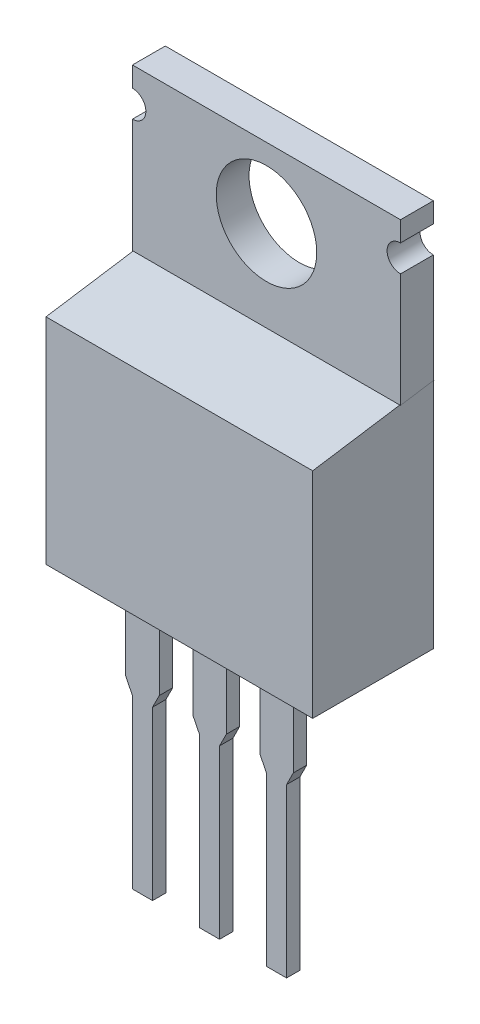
ISO-10303-21;
HEADER;
FILE_DESCRIPTION(('STEP AP214'),'2;1');
FILE_NAME('part.step','',(''),(''),'','','');
FILE_SCHEMA(('AUTOMOTIVE_DESIGN { 1 0 10303 214 1 1 1 1 }'));
ENDSEC;
DATA;
#1=APPLICATION_CONTEXT('core data for automotive mechanical design processes');
#2=APPLICATION_PROTOCOL_DEFINITION('international standard','automotive_design',2000,#1);
#3=PRODUCT_CONTEXT('',#1,'mechanical');
#4=PRODUCT('Part','Part','',(#3));
#5=PRODUCT_RELATED_PRODUCT_CATEGORY('part','',(#4));
#6=PRODUCT_DEFINITION_FORMATION('','',#4);
#7=PRODUCT_DEFINITION_CONTEXT('part definition',#1,'design');
#8=PRODUCT_DEFINITION('design','',#6,#7);
#9=PRODUCT_DEFINITION_SHAPE('','',#8);
#10=(LENGTH_UNIT() NAMED_UNIT(*) SI_UNIT(.MILLI.,.METRE.));
#11=(NAMED_UNIT(*) PLANE_ANGLE_UNIT() SI_UNIT($,.RADIAN.));
#12=(NAMED_UNIT(*) SI_UNIT($,.STERADIAN.) SOLID_ANGLE_UNIT());
#13=UNCERTAINTY_MEASURE_WITH_UNIT(LENGTH_MEASURE(1.E-05),#10,'distance_accuracy_value','');
#14=(GEOMETRIC_REPRESENTATION_CONTEXT(3) GLOBAL_UNCERTAINTY_ASSIGNED_CONTEXT((#13)) GLOBAL_UNIT_ASSIGNED_CONTEXT((#10,
#11,#12)) REPRESENTATION_CONTEXT('',''));
#15=CARTESIAN_POINT('',(0.,0.,0.));
#16=DIRECTION('',(0.,0.,1.));
#17=DIRECTION('',(1.,0.,0.));
#18=AXIS2_PLACEMENT_3D('',#15,#16,#17);
#19=CARTESIAN_POINT('',(-2.54,3.81,-3.175));
#20=DIRECTION('',(0.,1.,0.));
#21=DIRECTION('',(0.,0.,1.));
#22=AXIS2_PLACEMENT_3D('',#19,#20,#21);
#23=PLANE('',#22);
#24=DIRECTION('',(1.,0.,0.));
#25=VECTOR('',#24,1.);
#26=CARTESIAN_POINT('',(1.905,3.81,0.254));
#27=LINE('',#26,#25);
#28=CARTESIAN_POINT('',(1.905,3.81,0.254));
#29=VERTEX_POINT('',#28);
#30=CARTESIAN_POINT('',(3.175,3.81,0.254));
#31=VERTEX_POINT('',#30);
#32=EDGE_CURVE('E363',#29,#31,#27,.T.);
#33=ORIENTED_EDGE('',*,*,#32,.T.);
#34=DIRECTION('',(0.,0.,-1.));
#35=VECTOR('',#34,1.);
#36=CARTESIAN_POINT('',(3.175,3.81,0.254));
#37=LINE('',#36,#35);
#38=CARTESIAN_POINT('',(3.175,3.81,-0.254));
#39=VERTEX_POINT('',#38);
#40=EDGE_CURVE('E379',#31,#39,#37,.T.);
#41=ORIENTED_EDGE('',*,*,#40,.T.);
#42=DIRECTION('',(1.,0.,0.));
#43=VECTOR('',#42,1.);
#44=CARTESIAN_POINT('',(1.905,3.81,-0.254));
#45=LINE('',#44,#43);
#46=CARTESIAN_POINT('',(1.905,3.81,-0.254));
#47=VERTEX_POINT('',#46);
#48=EDGE_CURVE('E357',#47,#39,#45,.T.);
#49=ORIENTED_EDGE('',*,*,#48,.F.);
#50=DIRECTION('',(0.,0.,-1.));
#51=VECTOR('',#50,1.);
#52=CARTESIAN_POINT('',(1.905,3.81,0.254));
#53=LINE('',#52,#51);
#54=EDGE_CURVE('E366',#29,#47,#53,.T.);
#55=ORIENTED_EDGE('',*,*,#54,.F.);
#56=EDGE_LOOP('',(#33,#41,#49,#55));
#57=FACE_BOUND('',#56,.T.);
#58=DIRECTION('',(0.,0.,-1.));
#59=VECTOR('',#58,1.);
#60=CARTESIAN_POINT('',(7.5946,3.81,1.397));
#61=LINE('',#60,#59);
#62=CARTESIAN_POINT('',(7.5946,3.81,1.397));
#63=VERTEX_POINT('',#62);
#64=CARTESIAN_POINT('',(7.5946,3.81,-3.175));
#65=VERTEX_POINT('',#64);
#66=EDGE_CURVE('E505',#63,#65,#61,.T.);
#67=ORIENTED_EDGE('',*,*,#66,.F.);
#68=DIRECTION('',(1.,0.,0.));
#69=VECTOR('',#68,1.);
#70=CARTESIAN_POINT('',(-2.54,3.81,1.397));
#71=LINE('',#70,#69);
#72=CARTESIAN_POINT('',(-2.5146,3.81,1.397));
#73=VERTEX_POINT('',#72);
#74=EDGE_CURVE('E553',#73,#63,#71,.T.);
#75=ORIENTED_EDGE('',*,*,#74,.F.);
#76=DIRECTION('',(0.,0.,1.));
#77=VECTOR('',#76,1.);
#78=CARTESIAN_POINT('',(-2.5146,3.81,-3.175));
#79=LINE('',#78,#77);
#80=CARTESIAN_POINT('',(-2.5146,3.81,-3.175));
#81=VERTEX_POINT('',#80);
#82=EDGE_CURVE('E528',#81,#73,#79,.T.);
#83=ORIENTED_EDGE('',*,*,#82,.F.);
#84=DIRECTION('',(-1.,0.,0.));
#85=VECTOR('',#84,1.);
#86=CARTESIAN_POINT('',(-2.54,3.81,-3.175));
#87=LINE('',#86,#85);
#88=EDGE_CURVE('E557',#65,#81,#87,.T.);
#89=ORIENTED_EDGE('',*,*,#88,.F.);
#90=EDGE_LOOP('',(#67,#75,#83,#89));
#91=FACE_BOUND('',#90,.T.);
#92=DIRECTION('',(1.,0.,0.));
#93=VECTOR('',#92,1.);
#94=CARTESIAN_POINT('',(-0.635,3.81,0.254));
#95=LINE('',#94,#93);
#96=CARTESIAN_POINT('',(-0.635,3.81,0.254));
#97=VERTEX_POINT('',#96);
#98=CARTESIAN_POINT('',(0.635,3.81,0.254));
#99=VERTEX_POINT('',#98);
#100=EDGE_CURVE('E417',#97,#99,#95,.T.);
#101=ORIENTED_EDGE('',*,*,#100,.T.);
#102=DIRECTION('',(0.,0.,-1.));
#103=VECTOR('',#102,1.);
#104=CARTESIAN_POINT('',(0.635,3.81,0.254));
#105=LINE('',#104,#103);
#106=CARTESIAN_POINT('',(0.635,3.81,-0.254));
#107=VERTEX_POINT('',#106);
#108=EDGE_CURVE('E433',#99,#107,#105,.T.);
#109=ORIENTED_EDGE('',*,*,#108,.T.);
#110=DIRECTION('',(1.,0.,0.));
#111=VECTOR('',#110,1.);
#112=CARTESIAN_POINT('',(-0.635,3.81,-0.254));
#113=LINE('',#112,#111);
#114=CARTESIAN_POINT('',(-0.635,3.81,-0.254));
#115=VERTEX_POINT('',#114);
#116=EDGE_CURVE('E411',#115,#107,#113,.T.);
#117=ORIENTED_EDGE('',*,*,#116,.F.);
#118=DIRECTION('',(0.,0.,-1.));
#119=VECTOR('',#118,1.);
#120=CARTESIAN_POINT('',(-0.635,3.81,0.254));
#121=LINE('',#120,#119);
#122=EDGE_CURVE('E420',#97,#115,#121,.T.);
#123=ORIENTED_EDGE('',*,*,#122,.F.);
#124=EDGE_LOOP('',(#101,#109,#117,#123));
#125=FACE_BOUND('',#124,.T.);
#126=DIRECTION('',(1.,0.,0.));
#127=VECTOR('',#126,1.);
#128=CARTESIAN_POINT('',(4.445,3.81,0.253999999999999));
#129=LINE('',#128,#127);
#130=CARTESIAN_POINT('',(4.445,3.81,0.253999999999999));
#131=VERTEX_POINT('',#130);
#132=CARTESIAN_POINT('',(5.715,3.81,0.253999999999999));
#133=VERTEX_POINT('',#132);
#134=EDGE_CURVE('E322',#131,#133,#129,.T.);
#135=ORIENTED_EDGE('',*,*,#134,.T.);
#136=DIRECTION('',(0.,0.,-1.));
#137=VECTOR('',#136,1.);
#138=CARTESIAN_POINT('',(5.715,3.81,0.253999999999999));
#139=LINE('',#138,#137);
#140=CARTESIAN_POINT('',(5.715,3.81,-0.254000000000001));
#141=VERTEX_POINT('',#140);
#142=EDGE_CURVE('E349',#133,#141,#139,.T.);
#143=ORIENTED_EDGE('',*,*,#142,.T.);
#144=DIRECTION('',(1.,0.,0.));
#145=VECTOR('',#144,1.);
#146=CARTESIAN_POINT('',(4.445,3.81,-0.254000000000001));
#147=LINE('',#146,#145);
#148=CARTESIAN_POINT('',(4.445,3.81,-0.254000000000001));
#149=VERTEX_POINT('',#148);
#150=EDGE_CURVE('E325',#149,#141,#147,.T.);
#151=ORIENTED_EDGE('',*,*,#150,.F.);
#152=DIRECTION('',(0.,0.,-1.));
#153=VECTOR('',#152,1.);
#154=CARTESIAN_POINT('',(4.445,3.81,0.253999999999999));
#155=LINE('',#154,#153);
#156=EDGE_CURVE('E340',#131,#149,#155,.T.);
#157=ORIENTED_EDGE('',*,*,#156,.F.);
#158=EDGE_LOOP('',(#135,#143,#151,#157));
#159=FACE_BOUND('',#158,.T.);
#160=ADVANCED_FACE('F33',(#57,#91,#125,#159),#23,.F.);
#161=CARTESIAN_POINT('',(-2.54,18.542,-3.175));
#162=DIRECTION('',(1.,0.,0.));
#163=DIRECTION('',(0.,0.,-1.));
#164=AXIS2_PLACEMENT_3D('',#161,#162,#163);
#165=PLANE('',#164);
#166=DIRECTION('',(0.,1.,0.));
#167=VECTOR('',#166,1.);
#168=CARTESIAN_POINT('',(-2.54,18.542,-3.1496));
#169=LINE('',#168,#167);
#170=CARTESIAN_POINT('',(-2.54,17.78,-3.1496));
#171=VERTEX_POINT('',#170);
#172=CARTESIAN_POINT('',(-2.54,18.542,-3.1496));
#173=VERTEX_POINT('',#172);
#174=EDGE_CURVE('E473',#171,#173,#169,.T.);
#175=ORIENTED_EDGE('',*,*,#174,.F.);
#176=DIRECTION('',(0.,0.,1.));
#177=VECTOR('',#176,1.);
#178=CARTESIAN_POINT('',(-2.54,17.78,-4.445));
#179=LINE('',#178,#177);
#180=CARTESIAN_POINT('',(-2.54,17.78,-1.905));
#181=VERTEX_POINT('',#180);
#182=EDGE_CURVE('E438',#171,#181,#179,.T.);
#183=ORIENTED_EDGE('',*,*,#182,.T.);
#184=DIRECTION('',(0.,-1.,0.));
#185=VECTOR('',#184,1.);
#186=CARTESIAN_POINT('',(-2.54,18.542,-1.905));
#187=LINE('',#186,#185);
#188=CARTESIAN_POINT('',(-2.54,18.542,-1.905));
#189=VERTEX_POINT('',#188);
#190=EDGE_CURVE('E550',#189,#181,#187,.T.);
#191=ORIENTED_EDGE('',*,*,#190,.F.);
#192=DIRECTION('',(0.,0.,1.));
#193=VECTOR('',#192,1.);
#194=CARTESIAN_POINT('',(-2.54,18.542,-3.175));
#195=LINE('',#194,#193);
#196=EDGE_CURVE('E554',#173,#189,#195,.T.);
#197=ORIENTED_EDGE('',*,*,#196,.F.);
#198=EDGE_LOOP('',(#175,#183,#191,#197));
#199=FACE_BOUND('',#198,.T.);
#200=ADVANCED_FACE('F688',(#199),#165,.F.);
#201=CARTESIAN_POINT('',(7.62,18.542,-3.175));
#202=DIRECTION('',(-1.,0.,0.));
#203=DIRECTION('',(0.,0.,1.));
#204=AXIS2_PLACEMENT_3D('',#201,#202,#203);
#205=PLANE('',#204);
#206=DIRECTION('',(0.,-1.,0.));
#207=VECTOR('',#206,1.);
#208=CARTESIAN_POINT('',(7.62,18.542,-3.1496));
#209=LINE('',#208,#207);
#210=CARTESIAN_POINT('',(7.62,16.764,-3.1496));
#211=VERTEX_POINT('',#210);
#212=CARTESIAN_POINT('',(7.62,12.6413846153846,-3.1496));
#213=VERTEX_POINT('',#212);
#214=EDGE_CURVE('E453',#211,#213,#209,.T.);
#215=ORIENTED_EDGE('',*,*,#214,.F.);
#216=DIRECTION('',(0.,0.,1.));
#217=VECTOR('',#216,1.);
#218=CARTESIAN_POINT('',(7.62,16.764,-4.445));
#219=LINE('',#218,#217);
#220=CARTESIAN_POINT('',(7.62,16.764,-1.905));
#221=VERTEX_POINT('',#220);
#222=EDGE_CURVE('E445',#211,#221,#219,.T.);
#223=ORIENTED_EDGE('',*,*,#222,.T.);
#224=DIRECTION('',(0.,1.,0.));
#225=VECTOR('',#224,1.);
#226=CARTESIAN_POINT('',(7.62,18.542,-1.905));
#227=LINE('',#226,#225);
#228=CARTESIAN_POINT('',(7.61999999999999,12.446,-1.905));
#229=VERTEX_POINT('',#228);
#230=EDGE_CURVE('E546',#229,#221,#227,.T.);
#231=ORIENTED_EDGE('',*,*,#230,.F.);
#232=DIRECTION('',(0.,-0.15205718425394,0.988371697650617));
#233=VECTOR('',#232,1.);
#234=CARTESIAN_POINT('',(7.62,11.938,1.397));
#235=LINE('',#234,#233);
#236=CARTESIAN_POINT('',(7.62,12.6413846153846,-3.175));
#237=VERTEX_POINT('',#236);
#238=EDGE_CURVE('E506',#237,#229,#235,.T.);
#239=ORIENTED_EDGE('',*,*,#238,.F.);
#240=DIRECTION('',(0.,0.,-1.));
#241=VECTOR('',#240,1.);
#242=CARTESIAN_POINT('',(7.62,12.6413846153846,-3.1496));
#243=LINE('',#242,#241);
#244=EDGE_CURVE('E477',#213,#237,#243,.T.);
#245=ORIENTED_EDGE('',*,*,#244,.F.);
#246=EDGE_LOOP('',(#215,#223,#231,#239,#245));
#247=FACE_BOUND('',#246,.T.);
#248=ADVANCED_FACE('F693',(#247),#205,.F.);
#249=CARTESIAN_POINT('',(-2.54,18.542,1.397));
#250=DIRECTION('',(0.,0.,-1.));
#251=DIRECTION('',(-1.,0.,0.));
#252=AXIS2_PLACEMENT_3D('',#249,#250,#251);
#253=PLANE('',#252);
#254=DIRECTION('',(0.,-1.,0.));
#255=VECTOR('',#254,1.);
#256=CARTESIAN_POINT('',(7.5946,11.938,1.397));
#257=LINE('',#256,#255);
#258=CARTESIAN_POINT('',(7.5946,11.938,1.397));
#259=VERTEX_POINT('',#258);
#260=EDGE_CURVE('E503',#259,#63,#257,.T.);
#261=ORIENTED_EDGE('',*,*,#260,.F.);
#262=DIRECTION('',(1.,0.,0.));
#263=VECTOR('',#262,1.);
#264=CARTESIAN_POINT('',(-25.6281668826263,11.938,1.397));
#265=LINE('',#264,#263);
#266=CARTESIAN_POINT('',(-2.5146,11.938,1.397));
#267=VERTEX_POINT('',#266);
#268=EDGE_CURVE('E538',#267,#259,#265,.T.);
#269=ORIENTED_EDGE('',*,*,#268,.F.);
#270=DIRECTION('',(0.,1.,0.));
#271=VECTOR('',#270,1.);
#272=CARTESIAN_POINT('',(-2.5146,11.938,1.397));
#273=LINE('',#272,#271);
#274=EDGE_CURVE('E520',#73,#267,#273,.T.);
#275=ORIENTED_EDGE('',*,*,#274,.F.);
#276=ORIENTED_EDGE('',*,*,#74,.T.);
#277=EDGE_LOOP('',(#261,#269,#275,#276));
#278=FACE_BOUND('',#277,.T.);
#279=ADVANCED_FACE('F707',(#278),#253,.F.);
#280=CARTESIAN_POINT('',(-25.6281668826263,12.446,-1.905));
#281=DIRECTION('',(0.,0.988371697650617,0.152057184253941));
#282=DIRECTION('',(0.,-0.152057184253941,0.988371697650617));
#283=AXIS2_PLACEMENT_3D('',#280,#281,#282);
#284=PLANE('',#283);
#285=ORIENTED_EDGE('',*,*,#268,.T.);
#286=DIRECTION('',(0.,-0.15205718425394,0.988371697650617));
#287=VECTOR('',#286,1.);
#288=CARTESIAN_POINT('',(7.5946,11.938,1.397));
#289=LINE('',#288,#287);
#290=CARTESIAN_POINT('',(7.5946,12.446,-1.905));
#291=VERTEX_POINT('',#290);
#292=EDGE_CURVE('E511',#291,#259,#289,.T.);
#293=ORIENTED_EDGE('',*,*,#292,.F.);
#294=DIRECTION('',(1.,0.,0.));
#295=VECTOR('',#294,1.);
#296=CARTESIAN_POINT('',(-25.6281668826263,12.446,-1.905));
#297=LINE('',#296,#295);
#298=CARTESIAN_POINT('',(-2.5146,12.446,-1.905));
#299=VERTEX_POINT('',#298);
#300=EDGE_CURVE('E545',#299,#291,#297,.T.);
#301=ORIENTED_EDGE('',*,*,#300,.F.);
#302=DIRECTION('',(0.,0.152057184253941,-0.988371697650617));
#303=VECTOR('',#302,1.);
#304=CARTESIAN_POINT('',(-2.5146,12.6413846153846,-3.175));
#305=LINE('',#304,#303);
#306=EDGE_CURVE('E523',#267,#299,#305,.T.);
#307=ORIENTED_EDGE('',*,*,#306,.F.);
#308=EDGE_LOOP('',(#285,#293,#301,#307));
#309=FACE_BOUND('',#308,.T.);
#310=ADVANCED_FACE('F709',(#309),#284,.T.);
#311=CARTESIAN_POINT('',(-2.54,16.764,-1.905));
#312=VERTEX_POINT('',#311);
#313=CARTESIAN_POINT('',(-2.54,12.446,-1.905));
#314=VERTEX_POINT('',#313);
#315=EDGE_CURVE('E549',#312,#314,#187,.T.);
#316=ORIENTED_EDGE('',*,*,#315,.F.);
#317=DIRECTION('',(0.,0.,1.));
#318=VECTOR('',#317,1.);
#319=CARTESIAN_POINT('',(-2.54,16.764,-4.445));
#320=LINE('',#319,#318);
#321=CARTESIAN_POINT('',(-2.54,16.764,-3.1496));
#322=VERTEX_POINT('',#321);
#323=EDGE_CURVE('E439',#322,#312,#320,.T.);
#324=ORIENTED_EDGE('',*,*,#323,.F.);
#325=CARTESIAN_POINT('',(-2.54,12.6413846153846,-3.1496));
#326=VERTEX_POINT('',#325);
#327=EDGE_CURVE('E474',#326,#322,#169,.T.);
#328=ORIENTED_EDGE('',*,*,#327,.F.);
#329=DIRECTION('',(0.,0.,-1.));
#330=VECTOR('',#329,1.);
#331=CARTESIAN_POINT('',(-2.54,12.6413846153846,-3.1496));
#332=LINE('',#331,#330);
#333=CARTESIAN_POINT('',(-2.54,12.6413846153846,-3.175));
#334=VERTEX_POINT('',#333);
#335=EDGE_CURVE('E489',#326,#334,#332,.T.);
#336=ORIENTED_EDGE('',*,*,#335,.T.);
#337=DIRECTION('',(0.,0.152057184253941,-0.988371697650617));
#338=VECTOR('',#337,1.);
#339=CARTESIAN_POINT('',(-2.54,12.6413846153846,-3.175));
#340=LINE('',#339,#338);
#341=EDGE_CURVE('E519',#314,#334,#340,.T.);
#342=ORIENTED_EDGE('',*,*,#341,.F.);
#343=EDGE_LOOP('',(#316,#324,#328,#336,#342));
#344=FACE_BOUND('',#343,.T.);
#345=ADVANCED_FACE('F35',(#344),#165,.F.);
#346=CARTESIAN_POINT('',(7.61999999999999,17.78,-1.905));
#347=VERTEX_POINT('',#346);
#348=CARTESIAN_POINT('',(7.62,18.542,-1.905));
#349=VERTEX_POINT('',#348);
#350=EDGE_CURVE('E541',#347,#349,#227,.T.);
#351=ORIENTED_EDGE('',*,*,#350,.F.);
#352=DIRECTION('',(0.,0.,1.));
#353=VECTOR('',#352,1.);
#354=CARTESIAN_POINT('',(7.61999999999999,17.78,-4.445));
#355=LINE('',#354,#353);
#356=CARTESIAN_POINT('',(7.61999999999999,17.78,-3.1496));
#357=VERTEX_POINT('',#356);
#358=EDGE_CURVE('E446',#357,#347,#355,.T.);
#359=ORIENTED_EDGE('',*,*,#358,.F.);
#360=CARTESIAN_POINT('',(7.62,18.542,-3.1496));
#361=VERTEX_POINT('',#360);
#362=EDGE_CURVE('E455',#361,#357,#209,.T.);
#363=ORIENTED_EDGE('',*,*,#362,.F.);
#364=DIRECTION('',(0.,0.,-1.));
#365=VECTOR('',#364,1.);
#366=CARTESIAN_POINT('',(7.62,18.542,-3.175));
#367=LINE('',#366,#365);
#368=EDGE_CURVE('E556',#349,#361,#367,.T.);
#369=ORIENTED_EDGE('',*,*,#368,.F.);
#370=EDGE_LOOP('',(#351,#359,#363,#369));
#371=FACE_BOUND('',#370,.T.);
#372=ADVANCED_FACE('F704',(#371),#205,.F.);
#373=CARTESIAN_POINT('',(-2.54,18.542,-3.175));
#374=DIRECTION('',(0.,1.,0.));
#375=DIRECTION('',(0.,0.,1.));
#376=AXIS2_PLACEMENT_3D('',#373,#374,#375);
#377=PLANE('',#376);
#378=DIRECTION('',(1.,0.,0.));
#379=VECTOR('',#378,1.);
#380=CARTESIAN_POINT('',(7.62,18.542,-3.1496));
#381=LINE('',#380,#379);
#382=EDGE_CURVE('E451',#173,#361,#381,.T.);
#383=ORIENTED_EDGE('',*,*,#382,.F.);
#384=ORIENTED_EDGE('',*,*,#196,.T.);
#385=DIRECTION('',(1.,0.,0.));
#386=VECTOR('',#385,1.);
#387=CARTESIAN_POINT('',(-2.54,18.542,-1.905));
#388=LINE('',#387,#386);
#389=EDGE_CURVE('E560',#189,#349,#388,.T.);
#390=ORIENTED_EDGE('',*,*,#389,.T.);
#391=ORIENTED_EDGE('',*,*,#368,.T.);
#392=EDGE_LOOP('',(#383,#384,#390,#391));
#393=FACE_BOUND('',#392,.T.);
#394=ADVANCED_FACE('F697',(#393),#377,.T.);
#395=CARTESIAN_POINT('',(-2.54,18.542,-3.175));
#396=DIRECTION('',(0.,0.,1.));
#397=DIRECTION('',(1.,0.,0.));
#398=AXIS2_PLACEMENT_3D('',#395,#396,#397);
#399=PLANE('',#398);
#400=DIRECTION('',(0.,-1.,0.));
#401=VECTOR('',#400,1.);
#402=CARTESIAN_POINT('',(-2.5146,12.6413846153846,-3.175));
#403=LINE('',#402,#401);
#404=CARTESIAN_POINT('',(-2.5146,12.6413846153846,-3.175));
#405=VERTEX_POINT('',#404);
#406=EDGE_CURVE('E525',#405,#81,#403,.T.);
#407=ORIENTED_EDGE('',*,*,#406,.F.);
#408=DIRECTION('',(-1.,0.,0.));
#409=VECTOR('',#408,1.);
#410=CARTESIAN_POINT('',(-1.27,12.6413846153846,-3.175));
#411=LINE('',#410,#409);
#412=CARTESIAN_POINT('',(-1.27,12.6413846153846,-3.175));
#413=VERTEX_POINT('',#412);
#414=EDGE_CURVE('E454',#413,#405,#411,.T.);
#415=ORIENTED_EDGE('',*,*,#414,.F.);
#416=DIRECTION('',(0.,1.,0.));
#417=VECTOR('',#416,1.);
#418=CARTESIAN_POINT('',(-1.27,12.6413846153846,-3.175));
#419=LINE('',#418,#417);
#420=CARTESIAN_POINT('',(-1.27,7.112,-3.175));
#421=VERTEX_POINT('',#420);
#422=EDGE_CURVE('E485',#421,#413,#419,.T.);
#423=ORIENTED_EDGE('',*,*,#422,.F.);
#424=DIRECTION('',(-1.,0.,0.));
#425=VECTOR('',#424,1.);
#426=CARTESIAN_POINT('',(6.35,7.112,-3.175));
#427=LINE('',#426,#425);
#428=CARTESIAN_POINT('',(6.35,7.112,-3.175));
#429=VERTEX_POINT('',#428);
#430=EDGE_CURVE('E482',#429,#421,#427,.T.);
#431=ORIENTED_EDGE('',*,*,#430,.F.);
#432=DIRECTION('',(0.,-1.,0.));
#433=VECTOR('',#432,1.);
#434=CARTESIAN_POINT('',(6.35,12.6413846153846,-3.175));
#435=LINE('',#434,#433);
#436=CARTESIAN_POINT('',(6.35,12.6413846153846,-3.175));
#437=VERTEX_POINT('',#436);
#438=EDGE_CURVE('E479',#437,#429,#435,.T.);
#439=ORIENTED_EDGE('',*,*,#438,.F.);
#440=DIRECTION('',(-1.,0.,0.));
#441=VECTOR('',#440,1.);
#442=CARTESIAN_POINT('',(7.62,12.6413846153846,-3.175));
#443=LINE('',#442,#441);
#444=CARTESIAN_POINT('',(7.5946,12.6413846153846,-3.175));
#445=VERTEX_POINT('',#444);
#446=EDGE_CURVE('E448',#445,#437,#443,.T.);
#447=ORIENTED_EDGE('',*,*,#446,.F.);
#448=DIRECTION('',(0.,1.,0.));
#449=VECTOR('',#448,1.);
#450=CARTESIAN_POINT('',(7.5946,12.6413846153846,-3.175));
#451=LINE('',#450,#449);
#452=EDGE_CURVE('E508',#65,#445,#451,.T.);
#453=ORIENTED_EDGE('',*,*,#452,.F.);
#454=ORIENTED_EDGE('',*,*,#88,.T.);
#455=EDGE_LOOP('',(#407,#415,#423,#431,#439,#447,#453,#454));
#456=FACE_BOUND('',#455,.T.);
#457=ADVANCED_FACE('F699',(#456),#399,.F.);
#458=CARTESIAN_POINT('',(-25.6281668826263,12.446,-1.905));
#459=DIRECTION('',(0.,0.,1.));
#460=DIRECTION('',(1.,0.,0.));
#461=AXIS2_PLACEMENT_3D('',#458,#459,#460);
#462=PLANE('',#461);
#463=CARTESIAN_POINT('',(-2.54,17.272,-1.905));
#464=DIRECTION('',(0.,0.,1.));
#465=DIRECTION('',(1.,0.,0.));
#466=AXIS2_PLACEMENT_3D('',#463,#464,#465);
#467=CIRCLE('',#466,0.508000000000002);
#468=EDGE_CURVE('E436',#312,#181,#467,.T.);
#469=ORIENTED_EDGE('',*,*,#468,.F.);
#470=ORIENTED_EDGE('',*,*,#315,.T.);
#471=EDGE_CURVE('E542',#314,#299,#297,.T.);
#472=ORIENTED_EDGE('',*,*,#471,.T.);
#473=ORIENTED_EDGE('',*,*,#300,.T.);
#474=EDGE_CURVE('E537',#291,#229,#297,.T.);
#475=ORIENTED_EDGE('',*,*,#474,.T.);
#476=ORIENTED_EDGE('',*,*,#230,.T.);
#477=CARTESIAN_POINT('',(7.61999999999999,17.272,-1.905));
#478=DIRECTION('',(0.,0.,1.));
#479=DIRECTION('',(1.,0.,0.));
#480=AXIS2_PLACEMENT_3D('',#477,#478,#479);
#481=CIRCLE('',#480,0.508000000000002);
#482=EDGE_CURVE('E441',#347,#221,#481,.T.);
#483=ORIENTED_EDGE('',*,*,#482,.F.);
#484=ORIENTED_EDGE('',*,*,#350,.T.);
#485=ORIENTED_EDGE('',*,*,#389,.F.);
#486=ORIENTED_EDGE('',*,*,#190,.T.);
#487=EDGE_LOOP('',(#469,#470,#472,#473,#475,#476,#483,#484,#485,#486));
#488=FACE_BOUND('',#487,.T.);
#489=CARTESIAN_POINT('',(2.54,15.875,-1.905));
#490=DIRECTION('',(0.,0.,1.));
#491=DIRECTION('',(1.,0.,0.));
#492=AXIS2_PLACEMENT_3D('',#489,#490,#491);
#493=CIRCLE('',#492,1.905);
#494=CARTESIAN_POINT('',(4.445,15.875,-1.905));
#495=VERTEX_POINT('',#494);
#496=EDGE_CURVE('E534',#495,#495,#493,.T.);
#497=ORIENTED_EDGE('',*,*,#496,.F.);
#498=EDGE_LOOP('',(#497));
#499=FACE_BOUND('',#498,.T.);
#500=ADVANCED_FACE('F702',(#488,#499),#462,.T.);
#501=CARTESIAN_POINT('',(2.54,15.875,-16.637));
#502=DIRECTION('',(0.,0.,1.));
#503=DIRECTION('',(1.,0.,0.));
#504=AXIS2_PLACEMENT_3D('',#501,#502,#503);
#505=CYLINDRICAL_SURFACE('',#504,1.905);
#506=CARTESIAN_POINT('',(2.54,15.875,-3.1496));
#507=DIRECTION('',(0.,0.,1.));
#508=DIRECTION('',(1.,0.,0.));
#509=AXIS2_PLACEMENT_3D('',#506,#507,#508);
#510=CIRCLE('',#509,1.905);
#511=CARTESIAN_POINT('',(4.445,15.875,-3.1496));
#512=VERTEX_POINT('',#511);
#513=EDGE_CURVE('E492',#512,#512,#510,.F.);
#514=ORIENTED_EDGE('',*,*,#513,.T.);
#515=EDGE_LOOP('',(#514));
#516=FACE_BOUND('',#515,.T.);
#517=ORIENTED_EDGE('',*,*,#496,.T.);
#518=EDGE_LOOP('',(#517));
#519=FACE_BOUND('',#518,.T.);
#520=ADVANCED_FACE('F803',(#516,#519),#505,.F.);
#521=CARTESIAN_POINT('',(-2.5146,12.6413846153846,-3.175));
#522=DIRECTION('',(0.,0.988371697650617,0.152057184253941));
#523=DIRECTION('',(0.,-0.152057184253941,0.988371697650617));
#524=AXIS2_PLACEMENT_3D('',#521,#522,#523);
#525=PLANE('',#524);
#526=ORIENTED_EDGE('',*,*,#471,.F.);
#527=ORIENTED_EDGE('',*,*,#341,.T.);
#528=DIRECTION('',(-1.,0.,0.));
#529=VECTOR('',#528,1.);
#530=CARTESIAN_POINT('',(-2.5146,12.6413846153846,-3.175));
#531=LINE('',#530,#529);
#532=EDGE_CURVE('E530',#405,#334,#531,.T.);
#533=ORIENTED_EDGE('',*,*,#532,.F.);
#534=EDGE_CURVE('E522',#299,#405,#305,.T.);
#535=ORIENTED_EDGE('',*,*,#534,.F.);
#536=EDGE_LOOP('',(#526,#527,#533,#535));
#537=FACE_BOUND('',#536,.T.);
#538=ADVANCED_FACE('F735',(#537),#525,.F.);
#539=CARTESIAN_POINT('',(-2.5146,3.81,1.397));
#540=DIRECTION('',(-1.,0.,0.));
#541=DIRECTION('',(0.,0.,1.));
#542=AXIS2_PLACEMENT_3D('',#539,#540,#541);
#543=PLANE('',#542);
#544=ORIENTED_EDGE('',*,*,#274,.T.);
#545=ORIENTED_EDGE('',*,*,#306,.T.);
#546=ORIENTED_EDGE('',*,*,#534,.T.);
#547=ORIENTED_EDGE('',*,*,#406,.T.);
#548=ORIENTED_EDGE('',*,*,#82,.T.);
#549=EDGE_LOOP('',(#544,#545,#546,#547,#548));
#550=FACE_BOUND('',#549,.T.);
#551=ADVANCED_FACE('F731',(#550),#543,.T.);
#552=CARTESIAN_POINT('',(7.5946,11.938,1.397));
#553=DIRECTION('',(0.,0.988371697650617,0.15205718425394));
#554=DIRECTION('',(0.,-0.15205718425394,0.988371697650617));
#555=AXIS2_PLACEMENT_3D('',#552,#553,#554);
#556=PLANE('',#555);
#557=ORIENTED_EDGE('',*,*,#474,.F.);
#558=EDGE_CURVE('E512',#445,#291,#289,.T.);
#559=ORIENTED_EDGE('',*,*,#558,.F.);
#560=DIRECTION('',(1.,0.,0.));
#561=VECTOR('',#560,1.);
#562=CARTESIAN_POINT('',(7.5946,12.6413846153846,-3.175));
#563=LINE('',#562,#561);
#564=EDGE_CURVE('E515',#445,#237,#563,.T.);
#565=ORIENTED_EDGE('',*,*,#564,.T.);
#566=ORIENTED_EDGE('',*,*,#238,.T.);
#567=EDGE_LOOP('',(#557,#559,#565,#566));
#568=FACE_BOUND('',#567,.T.);
#569=ADVANCED_FACE('F766',(#568),#556,.F.);
#570=CARTESIAN_POINT('',(7.5946,3.81,1.397));
#571=DIRECTION('',(1.,0.,0.));
#572=DIRECTION('',(0.,0.,-1.));
#573=AXIS2_PLACEMENT_3D('',#570,#571,#572);
#574=PLANE('',#573);
#575=ORIENTED_EDGE('',*,*,#260,.T.);
#576=ORIENTED_EDGE('',*,*,#66,.T.);
#577=ORIENTED_EDGE('',*,*,#452,.T.);
#578=ORIENTED_EDGE('',*,*,#558,.T.);
#579=ORIENTED_EDGE('',*,*,#292,.T.);
#580=EDGE_LOOP('',(#575,#576,#577,#578,#579));
#581=FACE_BOUND('',#580,.T.);
#582=ADVANCED_FACE('F745',(#581),#574,.T.);
#583=CARTESIAN_POINT('',(-2.54,18.542,-3.1496));
#584=DIRECTION('',(0.,0.,1.));
#585=DIRECTION('',(1.,0.,0.));
#586=AXIS2_PLACEMENT_3D('',#583,#584,#585);
#587=PLANE('',#586);
#588=ORIENTED_EDGE('',*,*,#327,.T.);
#589=CARTESIAN_POINT('',(-2.54,17.272,-3.1496));
#590=DIRECTION('',(0.,0.,1.));
#591=DIRECTION('',(1.,0.,0.));
#592=AXIS2_PLACEMENT_3D('',#589,#590,#591);
#593=CIRCLE('',#592,0.508000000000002);
#594=EDGE_CURVE('E571',#322,#171,#593,.T.);
#595=ORIENTED_EDGE('',*,*,#594,.T.);
#596=ORIENTED_EDGE('',*,*,#174,.T.);
#597=ORIENTED_EDGE('',*,*,#382,.T.);
#598=ORIENTED_EDGE('',*,*,#362,.T.);
#599=CARTESIAN_POINT('',(7.61999999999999,17.272,-3.1496));
#600=DIRECTION('',(0.,0.,1.));
#601=DIRECTION('',(1.,0.,0.));
#602=AXIS2_PLACEMENT_3D('',#599,#600,#601);
#603=CIRCLE('',#602,0.508000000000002);
#604=EDGE_CURVE('E566',#357,#211,#603,.T.);
#605=ORIENTED_EDGE('',*,*,#604,.T.);
#606=ORIENTED_EDGE('',*,*,#214,.T.);
#607=DIRECTION('',(-1.,0.,0.));
#608=VECTOR('',#607,1.);
#609=CARTESIAN_POINT('',(7.62,12.6413846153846,-3.1496));
#610=LINE('',#609,#608);
#611=CARTESIAN_POINT('',(6.35,12.6413846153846,-3.1496));
#612=VERTEX_POINT('',#611);
#613=EDGE_CURVE('E458',#213,#612,#610,.T.);
#614=ORIENTED_EDGE('',*,*,#613,.T.);
#615=DIRECTION('',(0.,-1.,0.));
#616=VECTOR('',#615,1.);
#617=CARTESIAN_POINT('',(6.35,12.6413846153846,-3.1496));
#618=LINE('',#617,#616);
#619=CARTESIAN_POINT('',(6.35,7.112,-3.1496));
#620=VERTEX_POINT('',#619);
#621=EDGE_CURVE('E461',#612,#620,#618,.T.);
#622=ORIENTED_EDGE('',*,*,#621,.T.);
#623=DIRECTION('',(-1.,0.,0.));
#624=VECTOR('',#623,1.);
#625=CARTESIAN_POINT('',(6.35,7.112,-3.1496));
#626=LINE('',#625,#624);
#627=CARTESIAN_POINT('',(-1.27,7.112,-3.1496));
#628=VERTEX_POINT('',#627);
#629=EDGE_CURVE('E464',#620,#628,#626,.T.);
#630=ORIENTED_EDGE('',*,*,#629,.T.);
#631=DIRECTION('',(0.,1.,0.));
#632=VECTOR('',#631,1.);
#633=CARTESIAN_POINT('',(-1.27,12.6413846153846,-3.1496));
#634=LINE('',#633,#632);
#635=CARTESIAN_POINT('',(-1.27,12.6413846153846,-3.1496));
#636=VERTEX_POINT('',#635);
#637=EDGE_CURVE('E467',#628,#636,#634,.T.);
#638=ORIENTED_EDGE('',*,*,#637,.T.);
#639=DIRECTION('',(-1.,0.,0.));
#640=VECTOR('',#639,1.);
#641=CARTESIAN_POINT('',(-1.27,12.6413846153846,-3.1496));
#642=LINE('',#641,#640);
#643=EDGE_CURVE('E470',#636,#326,#642,.T.);
#644=ORIENTED_EDGE('',*,*,#643,.T.);
#645=EDGE_LOOP('',(#588,#595,#596,#597,#598,#605,#606,#614,#622,#630,#638,#644));
#646=FACE_BOUND('',#645,.T.);
#647=ORIENTED_EDGE('',*,*,#513,.F.);
#648=EDGE_LOOP('',(#647));
#649=FACE_BOUND('',#648,.T.);
#650=ADVANCED_FACE('F758',(#646,#649),#587,.F.);
#651=CARTESIAN_POINT('',(-1.27,12.6413846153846,-3.1496));
#652=DIRECTION('',(0.,-1.,0.));
#653=DIRECTION('',(0.,0.,-1.));
#654=AXIS2_PLACEMENT_3D('',#651,#652,#653);
#655=PLANE('',#654);
#656=ORIENTED_EDGE('',*,*,#414,.T.);
#657=ORIENTED_EDGE('',*,*,#532,.T.);
#658=ORIENTED_EDGE('',*,*,#335,.F.);
#659=ORIENTED_EDGE('',*,*,#643,.F.);
#660=DIRECTION('',(0.,0.,-1.));
#661=VECTOR('',#660,1.);
#662=CARTESIAN_POINT('',(-1.27,12.6413846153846,-3.1496));
#663=LINE('',#662,#661);
#664=EDGE_CURVE('E493',#636,#413,#663,.T.);
#665=ORIENTED_EDGE('',*,*,#664,.T.);
#666=EDGE_LOOP('',(#656,#657,#658,#659,#665));
#667=FACE_BOUND('',#666,.T.);
#668=ADVANCED_FACE('F776',(#667),#655,.F.);
#669=CARTESIAN_POINT('',(-1.27,12.6413846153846,-3.1496));
#670=DIRECTION('',(-1.,0.,0.));
#671=DIRECTION('',(0.,0.,1.));
#672=AXIS2_PLACEMENT_3D('',#669,#670,#671);
#673=PLANE('',#672);
#674=ORIENTED_EDGE('',*,*,#422,.T.);
#675=ORIENTED_EDGE('',*,*,#664,.F.);
#676=ORIENTED_EDGE('',*,*,#637,.F.);
#677=DIRECTION('',(0.,0.,-1.));
#678=VECTOR('',#677,1.);
#679=CARTESIAN_POINT('',(-1.27,7.112,-3.1496));
#680=LINE('',#679,#678);
#681=EDGE_CURVE('E495',#628,#421,#680,.T.);
#682=ORIENTED_EDGE('',*,*,#681,.T.);
#683=EDGE_LOOP('',(#674,#675,#676,#682));
#684=FACE_BOUND('',#683,.T.);
#685=ADVANCED_FACE('F779',(#684),#673,.F.);
#686=CARTESIAN_POINT('',(6.35,7.112,-3.1496));
#687=DIRECTION('',(0.,-1.,0.));
#688=DIRECTION('',(0.,0.,-1.));
#689=AXIS2_PLACEMENT_3D('',#686,#687,#688);
#690=PLANE('',#689);
#691=ORIENTED_EDGE('',*,*,#430,.T.);
#692=ORIENTED_EDGE('',*,*,#681,.F.);
#693=ORIENTED_EDGE('',*,*,#629,.F.);
#694=DIRECTION('',(0.,0.,-1.));
#695=VECTOR('',#694,1.);
#696=CARTESIAN_POINT('',(6.35,7.112,-3.1496));
#697=LINE('',#696,#695);
#698=EDGE_CURVE('E497',#620,#429,#697,.T.);
#699=ORIENTED_EDGE('',*,*,#698,.T.);
#700=EDGE_LOOP('',(#691,#692,#693,#699));
#701=FACE_BOUND('',#700,.T.);
#702=ADVANCED_FACE('F781',(#701),#690,.F.);
#703=CARTESIAN_POINT('',(6.35,12.6413846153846,-3.1496));
#704=DIRECTION('',(1.,0.,0.));
#705=DIRECTION('',(0.,1.,0.));
#706=AXIS2_PLACEMENT_3D('',#703,#704,#705);
#707=PLANE('',#706);
#708=ORIENTED_EDGE('',*,*,#438,.T.);
#709=ORIENTED_EDGE('',*,*,#698,.F.);
#710=ORIENTED_EDGE('',*,*,#621,.F.);
#711=DIRECTION('',(0.,0.,-1.));
#712=VECTOR('',#711,1.);
#713=CARTESIAN_POINT('',(6.35,12.6413846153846,-3.1496));
#714=LINE('',#713,#712);
#715=EDGE_CURVE('E499',#612,#437,#714,.T.);
#716=ORIENTED_EDGE('',*,*,#715,.T.);
#717=EDGE_LOOP('',(#708,#709,#710,#716));
#718=FACE_BOUND('',#717,.T.);
#719=ADVANCED_FACE('F755',(#718),#707,.F.);
#720=CARTESIAN_POINT('',(7.62,12.6413846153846,-3.1496));
#721=DIRECTION('',(0.,-1.,0.));
#722=DIRECTION('',(0.,0.,-1.));
#723=AXIS2_PLACEMENT_3D('',#720,#721,#722);
#724=PLANE('',#723);
#725=ORIENTED_EDGE('',*,*,#564,.F.);
#726=ORIENTED_EDGE('',*,*,#446,.T.);
#727=ORIENTED_EDGE('',*,*,#715,.F.);
#728=ORIENTED_EDGE('',*,*,#613,.F.);
#729=ORIENTED_EDGE('',*,*,#244,.T.);
#730=EDGE_LOOP('',(#725,#726,#727,#728,#729));
#731=FACE_BOUND('',#730,.T.);
#732=ADVANCED_FACE('F751',(#731),#724,.F.);
#733=CARTESIAN_POINT('',(7.61999999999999,17.272,-4.445));
#734=DIRECTION('',(0.,0.,1.));
#735=DIRECTION('',(1.,0.,0.));
#736=AXIS2_PLACEMENT_3D('',#733,#734,#735);
#737=CYLINDRICAL_SURFACE('',#736,0.508000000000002);
#738=ORIENTED_EDGE('',*,*,#358,.T.);
#739=ORIENTED_EDGE('',*,*,#482,.T.);
#740=ORIENTED_EDGE('',*,*,#222,.F.);
#741=ORIENTED_EDGE('',*,*,#604,.F.);
#742=EDGE_LOOP('',(#738,#739,#740,#741));
#743=FACE_BOUND('',#742,.T.);
#744=ADVANCED_FACE('F794',(#743),#737,.F.);
#745=CARTESIAN_POINT('',(-2.54,17.272,-4.445));
#746=DIRECTION('',(0.,0.,1.));
#747=DIRECTION('',(1.,0.,0.));
#748=AXIS2_PLACEMENT_3D('',#745,#746,#747);
#749=CYLINDRICAL_SURFACE('',#748,0.508000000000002);
#750=ORIENTED_EDGE('',*,*,#323,.T.);
#751=ORIENTED_EDGE('',*,*,#468,.T.);
#752=ORIENTED_EDGE('',*,*,#182,.F.);
#753=ORIENTED_EDGE('',*,*,#594,.F.);
#754=EDGE_LOOP('',(#750,#751,#752,#753));
#755=FACE_BOUND('',#754,.T.);
#756=ADVANCED_FACE('F912',(#755),#749,.F.);
#757=CARTESIAN_POINT('',(-0.635,3.81,0.254));
#758=DIRECTION('',(1.,0.,0.));
#759=DIRECTION('',(0.,1.,0.));
#760=AXIS2_PLACEMENT_3D('',#757,#758,#759);
#761=PLANE('',#760);
#762=DIRECTION('',(0.,-1.,0.));
#763=VECTOR('',#762,1.);
#764=CARTESIAN_POINT('',(-0.635,3.81,-0.254));
#765=LINE('',#764,#763);
#766=CARTESIAN_POINT('',(-0.635,0.507999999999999,-0.254));
#767=VERTEX_POINT('',#766);
#768=EDGE_CURVE('E402',#115,#767,#765,.T.);
#769=ORIENTED_EDGE('',*,*,#768,.T.);
#770=DIRECTION('',(0.,0.,1.));
#771=VECTOR('',#770,1.);
#772=CARTESIAN_POINT('',(-0.635,0.507999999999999,-1.016));
#773=LINE('',#772,#771);
#774=CARTESIAN_POINT('',(-0.635,0.507999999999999,0.254));
#775=VERTEX_POINT('',#774);
#776=EDGE_CURVE('E387',#767,#775,#773,.T.);
#777=ORIENTED_EDGE('',*,*,#776,.T.);
#778=DIRECTION('',(0.,-1.,0.));
#779=VECTOR('',#778,1.);
#780=CARTESIAN_POINT('',(-0.635,3.81,0.254));
#781=LINE('',#780,#779);
#782=EDGE_CURVE('E407',#97,#775,#781,.T.);
#783=ORIENTED_EDGE('',*,*,#782,.F.);
#784=ORIENTED_EDGE('',*,*,#122,.T.);
#785=EDGE_LOOP('',(#769,#777,#783,#784));
#786=FACE_BOUND('',#785,.T.);
#787=ADVANCED_FACE('F922',(#786),#761,.F.);
#788=CARTESIAN_POINT('',(0.635000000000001,-6.35,0.254));
#789=DIRECTION('',(0.,-1.,0.));
#790=DIRECTION('',(0.,0.,-1.));
#791=AXIS2_PLACEMENT_3D('',#788,#789,#790);
#792=PLANE('',#791);
#793=DIRECTION('',(0.,0.,1.));
#794=VECTOR('',#793,1.);
#795=CARTESIAN_POINT('',(-0.380999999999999,-6.35000000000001,-1.016));
#796=LINE('',#795,#794);
#797=CARTESIAN_POINT('',(-0.380999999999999,-6.35000000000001,-0.254));
#798=VERTEX_POINT('',#797);
#799=CARTESIAN_POINT('',(-0.380999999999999,-6.35000000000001,0.254));
#800=VERTEX_POINT('',#799);
#801=EDGE_CURVE('E391',#798,#800,#796,.T.);
#802=ORIENTED_EDGE('',*,*,#801,.F.);
#803=DIRECTION('',(-1.,0.,0.));
#804=VECTOR('',#803,1.);
#805=CARTESIAN_POINT('',(0.635000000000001,-6.35,-0.254));
#806=LINE('',#805,#804);
#807=CARTESIAN_POINT('',(0.381,-6.35,-0.254));
#808=VERTEX_POINT('',#807);
#809=EDGE_CURVE('E423',#808,#798,#806,.T.);
#810=ORIENTED_EDGE('',*,*,#809,.F.);
#811=DIRECTION('',(0.,0.,1.));
#812=VECTOR('',#811,1.);
#813=CARTESIAN_POINT('',(0.380999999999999,-6.35000000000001,-1.016));
#814=LINE('',#813,#812);
#815=CARTESIAN_POINT('',(0.380999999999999,-6.35000000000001,0.254));
#816=VERTEX_POINT('',#815);
#817=EDGE_CURVE('E403',#808,#816,#814,.T.);
#818=ORIENTED_EDGE('',*,*,#817,.T.);
#819=DIRECTION('',(-1.,0.,0.));
#820=VECTOR('',#819,1.);
#821=CARTESIAN_POINT('',(0.635000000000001,-6.35,0.254));
#822=LINE('',#821,#820);
#823=EDGE_CURVE('E410',#816,#800,#822,.T.);
#824=ORIENTED_EDGE('',*,*,#823,.T.);
#825=EDGE_LOOP('',(#802,#810,#818,#824));
#826=FACE_BOUND('',#825,.T.);
#827=ADVANCED_FACE('F932',(#826),#792,.T.);
#828=CARTESIAN_POINT('',(0.635,3.81,0.254));
#829=DIRECTION('',(1.,0.,0.));
#830=DIRECTION('',(0.,1.,0.));
#831=AXIS2_PLACEMENT_3D('',#828,#829,#830);
#832=PLANE('',#831);
#833=DIRECTION('',(0.,0.,1.));
#834=VECTOR('',#833,1.);
#835=CARTESIAN_POINT('',(0.635,0.507999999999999,-1.016));
#836=LINE('',#835,#834);
#837=CARTESIAN_POINT('',(0.635,0.507999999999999,-0.254));
#838=VERTEX_POINT('',#837);
#839=CARTESIAN_POINT('',(0.635,0.507999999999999,0.254));
#840=VERTEX_POINT('',#839);
#841=EDGE_CURVE('E400',#838,#840,#836,.T.);
#842=ORIENTED_EDGE('',*,*,#841,.F.);
#843=DIRECTION('',(0.,-1.,0.));
#844=VECTOR('',#843,1.);
#845=CARTESIAN_POINT('',(0.635,3.81,-0.254));
#846=LINE('',#845,#844);
#847=EDGE_CURVE('E426',#107,#838,#846,.T.);
#848=ORIENTED_EDGE('',*,*,#847,.F.);
#849=ORIENTED_EDGE('',*,*,#108,.F.);
#850=DIRECTION('',(0.,-1.,0.));
#851=VECTOR('',#850,1.);
#852=CARTESIAN_POINT('',(0.635,3.81,0.254));
#853=LINE('',#852,#851);
#854=EDGE_CURVE('E414',#99,#840,#853,.T.);
#855=ORIENTED_EDGE('',*,*,#854,.T.);
#856=EDGE_LOOP('',(#842,#848,#849,#855));
#857=FACE_BOUND('',#856,.T.);
#858=ADVANCED_FACE('F942',(#857),#832,.T.);
#859=CARTESIAN_POINT('',(-0.634999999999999,-6.35,0.254));
#860=DIRECTION('',(0.,0.,-1.));
#861=DIRECTION('',(-1.,0.,0.));
#862=AXIS2_PLACEMENT_3D('',#859,#860,#861);
#863=PLANE('',#862);
#864=ORIENTED_EDGE('',*,*,#782,.T.);
#865=DIRECTION('',(-0.447213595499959,0.894427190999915,0.));
#866=VECTOR('',#865,1.);
#867=CARTESIAN_POINT('',(-0.381,0.,0.254));
#868=LINE('',#867,#866);
#869=CARTESIAN_POINT('',(-0.381,0.,0.254));
#870=VERTEX_POINT('',#869);
#871=EDGE_CURVE('E382',#870,#775,#868,.T.);
#872=ORIENTED_EDGE('',*,*,#871,.F.);
#873=DIRECTION('',(0.,1.,0.));
#874=VECTOR('',#873,1.);
#875=CARTESIAN_POINT('',(-0.381,0.,0.254));
#876=LINE('',#875,#874);
#877=EDGE_CURVE('E384',#800,#870,#876,.T.);
#878=ORIENTED_EDGE('',*,*,#877,.F.);
#879=ORIENTED_EDGE('',*,*,#823,.F.);
#880=DIRECTION('',(0.,-1.,0.));
#881=VECTOR('',#880,1.);
#882=CARTESIAN_POINT('',(0.381,0.,0.254));
#883=LINE('',#882,#881);
#884=CARTESIAN_POINT('',(0.381,0.,0.254));
#885=VERTEX_POINT('',#884);
#886=EDGE_CURVE('E397',#885,#816,#883,.T.);
#887=ORIENTED_EDGE('',*,*,#886,.F.);
#888=DIRECTION('',(-0.447213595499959,-0.894427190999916,0.));
#889=VECTOR('',#888,1.);
#890=CARTESIAN_POINT('',(0.381,0.,0.254));
#891=LINE('',#890,#889);
#892=EDGE_CURVE('E390',#840,#885,#891,.T.);
#893=ORIENTED_EDGE('',*,*,#892,.F.);
#894=ORIENTED_EDGE('',*,*,#854,.F.);
#895=ORIENTED_EDGE('',*,*,#100,.F.);
#896=EDGE_LOOP('',(#864,#872,#878,#879,#887,#893,#894,#895));
#897=FACE_BOUND('',#896,.T.);
#898=ADVANCED_FACE('F952',(#897),#863,.F.);
#899=CARTESIAN_POINT('',(-0.634999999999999,-6.35,-0.254));
#900=DIRECTION('',(0.,0.,-1.));
#901=DIRECTION('',(-1.,0.,0.));
#902=AXIS2_PLACEMENT_3D('',#899,#900,#901);
#903=PLANE('',#902);
#904=DIRECTION('',(0.447213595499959,-0.894427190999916,0.));
#905=VECTOR('',#904,1.);
#906=CARTESIAN_POINT('',(2.1082,-4.9784,-0.254));
#907=LINE('',#906,#905);
#908=CARTESIAN_POINT('',(-0.381,0.,-0.254));
#909=VERTEX_POINT('',#908);
#910=EDGE_CURVE('E580',#767,#909,#907,.T.);
#911=ORIENTED_EDGE('',*,*,#910,.F.);
#912=ORIENTED_EDGE('',*,*,#768,.F.);
#913=ORIENTED_EDGE('',*,*,#116,.T.);
#914=ORIENTED_EDGE('',*,*,#847,.T.);
#915=DIRECTION('',(0.447213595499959,0.894427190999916,0.));
#916=VECTOR('',#915,1.);
#917=CARTESIAN_POINT('',(-2.3622,-5.4864,-0.254));
#918=LINE('',#917,#916);
#919=CARTESIAN_POINT('',(0.381,0.,-0.254));
#920=VERTEX_POINT('',#919);
#921=EDGE_CURVE('E576',#920,#838,#918,.T.);
#922=ORIENTED_EDGE('',*,*,#921,.F.);
#923=DIRECTION('',(0.,1.,0.));
#924=VECTOR('',#923,1.);
#925=CARTESIAN_POINT('',(0.380999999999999,-6.35,-0.254));
#926=LINE('',#925,#924);
#927=EDGE_CURVE('E574',#808,#920,#926,.T.);
#928=ORIENTED_EDGE('',*,*,#927,.F.);
#929=ORIENTED_EDGE('',*,*,#809,.T.);
#930=DIRECTION('',(0.,-1.,0.));
#931=VECTOR('',#930,1.);
#932=CARTESIAN_POINT('',(-0.380999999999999,-6.35,-0.254));
#933=LINE('',#932,#931);
#934=EDGE_CURVE('E578',#909,#798,#933,.T.);
#935=ORIENTED_EDGE('',*,*,#934,.F.);
#936=EDGE_LOOP('',(#911,#912,#913,#914,#922,#928,#929,#935));
#937=FACE_BOUND('',#936,.T.);
#938=ADVANCED_FACE('F962',(#937),#903,.T.);
#939=CARTESIAN_POINT('',(0.381,0.,-1.016));
#940=DIRECTION('',(-0.894427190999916,0.447213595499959,0.));
#941=DIRECTION('',(-0.447213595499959,-0.894427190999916,0.));
#942=AXIS2_PLACEMENT_3D('',#939,#940,#941);
#943=PLANE('',#942);
#944=ORIENTED_EDGE('',*,*,#921,.T.);
#945=ORIENTED_EDGE('',*,*,#841,.T.);
#946=ORIENTED_EDGE('',*,*,#892,.T.);
#947=DIRECTION('',(0.,0.,1.));
#948=VECTOR('',#947,1.);
#949=CARTESIAN_POINT('',(0.381,0.,-1.016));
#950=LINE('',#949,#948);
#951=EDGE_CURVE('E399',#920,#885,#950,.T.);
#952=ORIENTED_EDGE('',*,*,#951,.F.);
#953=EDGE_LOOP('',(#944,#945,#946,#952));
#954=FACE_BOUND('',#953,.T.);
#955=ADVANCED_FACE('F972',(#954),#943,.F.);
#956=CARTESIAN_POINT('',(0.381,0.,-1.016));
#957=DIRECTION('',(-1.,0.,0.));
#958=DIRECTION('',(0.,-1.,0.));
#959=AXIS2_PLACEMENT_3D('',#956,#957,#958);
#960=PLANE('',#959);
#961=ORIENTED_EDGE('',*,*,#927,.T.);
#962=ORIENTED_EDGE('',*,*,#951,.T.);
#963=ORIENTED_EDGE('',*,*,#886,.T.);
#964=ORIENTED_EDGE('',*,*,#817,.F.);
#965=EDGE_LOOP('',(#961,#962,#963,#964));
#966=FACE_BOUND('',#965,.T.);
#967=ADVANCED_FACE('F982',(#966),#960,.F.);
#968=CARTESIAN_POINT('',(-0.381,0.,-1.016));
#969=DIRECTION('',(0.894427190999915,0.447213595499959,0.));
#970=DIRECTION('',(-0.447213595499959,0.894427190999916,0.));
#971=AXIS2_PLACEMENT_3D('',#968,#969,#970);
#972=PLANE('',#971);
#973=ORIENTED_EDGE('',*,*,#910,.T.);
#974=DIRECTION('',(0.,0.,1.));
#975=VECTOR('',#974,1.);
#976=CARTESIAN_POINT('',(-0.381,0.,-1.016));
#977=LINE('',#976,#975);
#978=EDGE_CURVE('E388',#909,#870,#977,.T.);
#979=ORIENTED_EDGE('',*,*,#978,.T.);
#980=ORIENTED_EDGE('',*,*,#871,.T.);
#981=ORIENTED_EDGE('',*,*,#776,.F.);
#982=EDGE_LOOP('',(#973,#979,#980,#981));
#983=FACE_BOUND('',#982,.T.);
#984=ADVANCED_FACE('F992',(#983),#972,.F.);
#985=CARTESIAN_POINT('',(-0.381,0.,-1.016));
#986=DIRECTION('',(1.,0.,0.));
#987=DIRECTION('',(0.,1.,0.));
#988=AXIS2_PLACEMENT_3D('',#985,#986,#987);
#989=PLANE('',#988);
#990=ORIENTED_EDGE('',*,*,#934,.T.);
#991=ORIENTED_EDGE('',*,*,#801,.T.);
#992=ORIENTED_EDGE('',*,*,#877,.T.);
#993=ORIENTED_EDGE('',*,*,#978,.F.);
#994=EDGE_LOOP('',(#990,#991,#992,#993));
#995=FACE_BOUND('',#994,.T.);
#996=ADVANCED_FACE('F1002',(#995),#989,.F.);
#997=CARTESIAN_POINT('',(1.905,3.81,0.254));
#998=DIRECTION('',(1.,0.,0.));
#999=DIRECTION('',(0.,1.,0.));
#1000=AXIS2_PLACEMENT_3D('',#997,#998,#999);
#1001=PLANE('',#1000);
#1002=DIRECTION('',(0.,-1.,0.));
#1003=VECTOR('',#1002,1.);
#1004=CARTESIAN_POINT('',(1.905,3.81,-0.254));
#1005=LINE('',#1004,#1003);
#1006=CARTESIAN_POINT('',(1.905,0.507999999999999,-0.254));
#1007=VERTEX_POINT('',#1006);
#1008=EDGE_CURVE('E352',#47,#1007,#1005,.T.);
#1009=ORIENTED_EDGE('',*,*,#1008,.T.);
#1010=DIRECTION('',(0.,0.,1.));
#1011=VECTOR('',#1010,1.);
#1012=CARTESIAN_POINT('',(1.905,0.507999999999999,-1.016));
#1013=LINE('',#1012,#1011);
#1014=CARTESIAN_POINT('',(1.905,0.507999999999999,0.254));
#1015=VERTEX_POINT('',#1014);
#1016=EDGE_CURVE('E628',#1007,#1015,#1013,.T.);
#1017=ORIENTED_EDGE('',*,*,#1016,.T.);
#1018=DIRECTION('',(0.,-1.,0.));
#1019=VECTOR('',#1018,1.);
#1020=CARTESIAN_POINT('',(1.905,3.81,0.254));
#1021=LINE('',#1020,#1019);
#1022=EDGE_CURVE('E353',#29,#1015,#1021,.T.);
#1023=ORIENTED_EDGE('',*,*,#1022,.F.);
#1024=ORIENTED_EDGE('',*,*,#54,.T.);
#1025=EDGE_LOOP('',(#1009,#1017,#1023,#1024));
#1026=FACE_BOUND('',#1025,.T.);
#1027=ADVANCED_FACE('F675',(#1026),#1001,.F.);
#1028=CARTESIAN_POINT('',(3.175,-6.35,0.254));
#1029=DIRECTION('',(0.,-1.,0.));
#1030=DIRECTION('',(0.,0.,-1.));
#1031=AXIS2_PLACEMENT_3D('',#1028,#1029,#1030);
#1032=PLANE('',#1031);
#1033=DIRECTION('',(0.,0.,1.));
#1034=VECTOR('',#1033,1.);
#1035=CARTESIAN_POINT('',(2.159,-6.35000000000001,-1.016));
#1036=LINE('',#1035,#1034);
#1037=CARTESIAN_POINT('',(2.159,-6.35000000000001,-0.254));
#1038=VERTEX_POINT('',#1037);
#1039=CARTESIAN_POINT('',(2.159,-6.35000000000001,0.254));
#1040=VERTEX_POINT('',#1039);
#1041=EDGE_CURVE('E632',#1038,#1040,#1036,.T.);
#1042=ORIENTED_EDGE('',*,*,#1041,.F.);
#1043=DIRECTION('',(-1.,0.,0.));
#1044=VECTOR('',#1043,1.);
#1045=CARTESIAN_POINT('',(3.175,-6.35,-0.254));
#1046=LINE('',#1045,#1044);
#1047=CARTESIAN_POINT('',(2.921,-6.35,-0.254));
#1048=VERTEX_POINT('',#1047);
#1049=EDGE_CURVE('E369',#1048,#1038,#1046,.T.);
#1050=ORIENTED_EDGE('',*,*,#1049,.F.);
#1051=DIRECTION('',(0.,0.,1.));
#1052=VECTOR('',#1051,1.);
#1053=CARTESIAN_POINT('',(2.921,-6.35000000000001,-1.016));
#1054=LINE('',#1053,#1052);
#1055=CARTESIAN_POINT('',(2.921,-6.35000000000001,0.254));
#1056=VERTEX_POINT('',#1055);
#1057=EDGE_CURVE('E640',#1048,#1056,#1054,.T.);
#1058=ORIENTED_EDGE('',*,*,#1057,.T.);
#1059=DIRECTION('',(-1.,0.,0.));
#1060=VECTOR('',#1059,1.);
#1061=CARTESIAN_POINT('',(3.175,-6.35,0.254));
#1062=LINE('',#1061,#1060);
#1063=EDGE_CURVE('E356',#1056,#1040,#1062,.T.);
#1064=ORIENTED_EDGE('',*,*,#1063,.T.);
#1065=EDGE_LOOP('',(#1042,#1050,#1058,#1064));
#1066=FACE_BOUND('',#1065,.T.);
#1067=ADVANCED_FACE('F661',(#1066),#1032,.T.);
#1068=CARTESIAN_POINT('',(3.175,3.81,0.254));
#1069=DIRECTION('',(1.,0.,0.));
#1070=DIRECTION('',(0.,1.,0.));
#1071=AXIS2_PLACEMENT_3D('',#1068,#1069,#1070);
#1072=PLANE('',#1071);
#1073=DIRECTION('',(0.,0.,1.));
#1074=VECTOR('',#1073,1.);
#1075=CARTESIAN_POINT('',(3.175,0.507999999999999,-1.016));
#1076=LINE('',#1075,#1074);
#1077=CARTESIAN_POINT('',(3.175,0.507999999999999,-0.254));
#1078=VERTEX_POINT('',#1077);
#1079=CARTESIAN_POINT('',(3.175,0.507999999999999,0.254));
#1080=VERTEX_POINT('',#1079);
#1081=EDGE_CURVE('E343',#1078,#1080,#1076,.T.);
#1082=ORIENTED_EDGE('',*,*,#1081,.F.);
#1083=DIRECTION('',(0.,-1.,0.));
#1084=VECTOR('',#1083,1.);
#1085=CARTESIAN_POINT('',(3.175,3.81,-0.254));
#1086=LINE('',#1085,#1084);
#1087=EDGE_CURVE('E372',#39,#1078,#1086,.T.);
#1088=ORIENTED_EDGE('',*,*,#1087,.F.);
#1089=ORIENTED_EDGE('',*,*,#40,.F.);
#1090=DIRECTION('',(0.,-1.,0.));
#1091=VECTOR('',#1090,1.);
#1092=CARTESIAN_POINT('',(3.175,3.81,0.254));
#1093=LINE('',#1092,#1091);
#1094=EDGE_CURVE('E360',#31,#1080,#1093,.T.);
#1095=ORIENTED_EDGE('',*,*,#1094,.T.);
#1096=EDGE_LOOP('',(#1082,#1088,#1089,#1095));
#1097=FACE_BOUND('',#1096,.T.);
#1098=ADVANCED_FACE('F668',(#1097),#1072,.T.);
#1099=CARTESIAN_POINT('',(1.905,-6.35,0.254));
#1100=DIRECTION('',(0.,0.,-1.));
#1101=DIRECTION('',(-1.,0.,0.));
#1102=AXIS2_PLACEMENT_3D('',#1099,#1100,#1101);
#1103=PLANE('',#1102);
#1104=ORIENTED_EDGE('',*,*,#1022,.T.);
#1105=DIRECTION('',(-0.447213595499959,0.894427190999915,0.));
#1106=VECTOR('',#1105,1.);
#1107=CARTESIAN_POINT('',(2.159,0.,0.254));
#1108=LINE('',#1107,#1106);
#1109=CARTESIAN_POINT('',(2.159,0.,0.254));
#1110=VERTEX_POINT('',#1109);
#1111=EDGE_CURVE('E623',#1110,#1015,#1108,.T.);
#1112=ORIENTED_EDGE('',*,*,#1111,.F.);
#1113=DIRECTION('',(0.,1.,0.));
#1114=VECTOR('',#1113,1.);
#1115=CARTESIAN_POINT('',(2.159,0.,0.254));
#1116=LINE('',#1115,#1114);
#1117=EDGE_CURVE('E625',#1040,#1110,#1116,.T.);
#1118=ORIENTED_EDGE('',*,*,#1117,.F.);
#1119=ORIENTED_EDGE('',*,*,#1063,.F.);
#1120=DIRECTION('',(0.,-1.,0.));
#1121=VECTOR('',#1120,1.);
#1122=CARTESIAN_POINT('',(2.921,0.,0.254));
#1123=LINE('',#1122,#1121);
#1124=CARTESIAN_POINT('',(2.921,0.,0.254));
#1125=VERTEX_POINT('',#1124);
#1126=EDGE_CURVE('E638',#1125,#1056,#1123,.T.);
#1127=ORIENTED_EDGE('',*,*,#1126,.F.);
#1128=DIRECTION('',(-0.447213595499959,-0.894427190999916,0.));
#1129=VECTOR('',#1128,1.);
#1130=CARTESIAN_POINT('',(2.921,0.,0.254));
#1131=LINE('',#1130,#1129);
#1132=EDGE_CURVE('E631',#1080,#1125,#1131,.T.);
#1133=ORIENTED_EDGE('',*,*,#1132,.F.);
#1134=ORIENTED_EDGE('',*,*,#1094,.F.);
#1135=ORIENTED_EDGE('',*,*,#32,.F.);
#1136=EDGE_LOOP('',(#1104,#1112,#1118,#1119,#1127,#1133,#1134,#1135));
#1137=FACE_BOUND('',#1136,.T.);
#1138=ADVANCED_FACE('F657',(#1137),#1103,.F.);
#1139=CARTESIAN_POINT('',(1.905,-6.35,-0.254));
#1140=DIRECTION('',(0.,0.,-1.));
#1141=DIRECTION('',(-1.,0.,0.));
#1142=AXIS2_PLACEMENT_3D('',#1139,#1140,#1141);
#1143=PLANE('',#1142);
#1144=DIRECTION('',(0.447213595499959,-0.894427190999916,0.));
#1145=VECTOR('',#1144,1.);
#1146=CARTESIAN_POINT('',(4.6482,-4.9784,-0.254));
#1147=LINE('',#1146,#1145);
#1148=CARTESIAN_POINT('',(2.159,0.,-0.254));
#1149=VERTEX_POINT('',#1148);
#1150=EDGE_CURVE('E589',#1007,#1149,#1147,.T.);
#1151=ORIENTED_EDGE('',*,*,#1150,.F.);
#1152=ORIENTED_EDGE('',*,*,#1008,.F.);
#1153=ORIENTED_EDGE('',*,*,#48,.T.);
#1154=ORIENTED_EDGE('',*,*,#1087,.T.);
#1155=DIRECTION('',(0.447213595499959,0.894427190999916,0.));
#1156=VECTOR('',#1155,1.);
#1157=CARTESIAN_POINT('',(0.177799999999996,-5.4864,-0.254));
#1158=LINE('',#1157,#1156);
#1159=CARTESIAN_POINT('',(2.921,0.,-0.254));
#1160=VERTEX_POINT('',#1159);
#1161=EDGE_CURVE('E585',#1160,#1078,#1158,.T.);
#1162=ORIENTED_EDGE('',*,*,#1161,.F.);
#1163=DIRECTION('',(0.,1.,0.));
#1164=VECTOR('',#1163,1.);
#1165=CARTESIAN_POINT('',(2.921,-6.35,-0.254));
#1166=LINE('',#1165,#1164);
#1167=EDGE_CURVE('E583',#1048,#1160,#1166,.T.);
#1168=ORIENTED_EDGE('',*,*,#1167,.F.);
#1169=ORIENTED_EDGE('',*,*,#1049,.T.);
#1170=DIRECTION('',(0.,-1.,0.));
#1171=VECTOR('',#1170,1.);
#1172=CARTESIAN_POINT('',(2.159,-6.35,-0.254));
#1173=LINE('',#1172,#1171);
#1174=EDGE_CURVE('E587',#1149,#1038,#1173,.T.);
#1175=ORIENTED_EDGE('',*,*,#1174,.F.);
#1176=EDGE_LOOP('',(#1151,#1152,#1153,#1154,#1162,#1168,#1169,#1175));
#1177=FACE_BOUND('',#1176,.T.);
#1178=ADVANCED_FACE('F666',(#1177),#1143,.T.);
#1179=CARTESIAN_POINT('',(4.445,3.81,0.253999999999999));
#1180=DIRECTION('',(1.,0.,0.));
#1181=DIRECTION('',(0.,1.,0.));
#1182=AXIS2_PLACEMENT_3D('',#1179,#1180,#1181);
#1183=PLANE('',#1182);
#1184=DIRECTION('',(0.,-1.,0.));
#1185=VECTOR('',#1184,1.);
#1186=CARTESIAN_POINT('',(4.445,3.81,-0.254000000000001));
#1187=LINE('',#1186,#1185);
#1188=CARTESIAN_POINT('',(4.445,0.507999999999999,-0.254000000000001));
#1189=VERTEX_POINT('',#1188);
#1190=EDGE_CURVE('E316',#149,#1189,#1187,.T.);
#1191=ORIENTED_EDGE('',*,*,#1190,.T.);
#1192=DIRECTION('',(0.,0.,1.));
#1193=VECTOR('',#1192,1.);
#1194=CARTESIAN_POINT('',(4.445,0.507999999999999,-1.016));
#1195=LINE('',#1194,#1193);
#1196=CARTESIAN_POINT('',(4.445,0.507999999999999,0.253999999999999));
#1197=VERTEX_POINT('',#1196);
#1198=EDGE_CURVE('E303',#1189,#1197,#1195,.T.);
#1199=ORIENTED_EDGE('',*,*,#1198,.T.);
#1200=DIRECTION('',(0.,-1.,0.));
#1201=VECTOR('',#1200,1.);
#1202=CARTESIAN_POINT('',(4.445,3.81,0.253999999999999));
#1203=LINE('',#1202,#1201);
#1204=EDGE_CURVE('E314',#131,#1197,#1203,.T.);
#1205=ORIENTED_EDGE('',*,*,#1204,.F.);
#1206=ORIENTED_EDGE('',*,*,#156,.T.);
#1207=EDGE_LOOP('',(#1191,#1199,#1205,#1206));
#1208=FACE_BOUND('',#1207,.T.);
#1209=ADVANCED_FACE('F312',(#1208),#1183,.F.);
#1210=CARTESIAN_POINT('',(5.715,-6.35,0.253999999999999));
#1211=DIRECTION('',(0.,-1.,0.));
#1212=DIRECTION('',(0.,0.,-1.));
#1213=AXIS2_PLACEMENT_3D('',#1210,#1211,#1212);
#1214=PLANE('',#1213);
#1215=DIRECTION('',(0.,0.,1.));
#1216=VECTOR('',#1215,1.);
#1217=CARTESIAN_POINT('',(4.699,-6.35000000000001,-1.016));
#1218=LINE('',#1217,#1216);
#1219=CARTESIAN_POINT('',(4.699,-6.35000000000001,-0.254000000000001));
#1220=VERTEX_POINT('',#1219);
#1221=CARTESIAN_POINT('',(4.699,-6.35000000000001,0.253999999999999));
#1222=VERTEX_POINT('',#1221);
#1223=EDGE_CURVE('E317',#1220,#1222,#1218,.T.);
#1224=ORIENTED_EDGE('',*,*,#1223,.F.);
#1225=DIRECTION('',(-1.,0.,0.));
#1226=VECTOR('',#1225,1.);
#1227=CARTESIAN_POINT('',(5.715,-6.35,-0.254000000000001));
#1228=LINE('',#1227,#1226);
#1229=CARTESIAN_POINT('',(5.461,-6.35,-0.254000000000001));
#1230=VERTEX_POINT('',#1229);
#1231=EDGE_CURVE('E342',#1230,#1220,#1228,.T.);
#1232=ORIENTED_EDGE('',*,*,#1231,.F.);
#1233=DIRECTION('',(0.,0.,1.));
#1234=VECTOR('',#1233,1.);
#1235=CARTESIAN_POINT('',(5.461,-6.35000000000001,-1.016));
#1236=LINE('',#1235,#1234);
#1237=CARTESIAN_POINT('',(5.461,-6.35000000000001,0.253999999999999));
#1238=VERTEX_POINT('',#1237);
#1239=EDGE_CURVE('E55',#1230,#1238,#1236,.T.);
#1240=ORIENTED_EDGE('',*,*,#1239,.T.);
#1241=DIRECTION('',(-1.,0.,0.));
#1242=VECTOR('',#1241,1.);
#1243=CARTESIAN_POINT('',(5.715,-6.35,0.253999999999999));
#1244=LINE('',#1243,#1242);
#1245=EDGE_CURVE('E324',#1238,#1222,#1244,.T.);
#1246=ORIENTED_EDGE('',*,*,#1245,.T.);
#1247=EDGE_LOOP('',(#1224,#1232,#1240,#1246));
#1248=FACE_BOUND('',#1247,.T.);
#1249=ADVANCED_FACE('F601',(#1248),#1214,.T.);
#1250=CARTESIAN_POINT('',(5.715,3.81,0.253999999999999));
#1251=DIRECTION('',(1.,0.,0.));
#1252=DIRECTION('',(0.,1.,0.));
#1253=AXIS2_PLACEMENT_3D('',#1250,#1251,#1252);
#1254=PLANE('',#1253);
#1255=DIRECTION('',(0.,0.,1.));
#1256=VECTOR('',#1255,1.);
#1257=CARTESIAN_POINT('',(5.715,0.507999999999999,-1.016));
#1258=LINE('',#1257,#1256);
#1259=CARTESIAN_POINT('',(5.715,0.507999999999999,-0.254000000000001));
#1260=VERTEX_POINT('',#1259);
#1261=CARTESIAN_POINT('',(5.715,0.507999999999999,0.253999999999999));
#1262=VERTEX_POINT('',#1261);
#1263=EDGE_CURVE('E618',#1260,#1262,#1258,.T.);
#1264=ORIENTED_EDGE('',*,*,#1263,.F.);
#1265=DIRECTION('',(0.,-1.,0.));
#1266=VECTOR('',#1265,1.);
#1267=CARTESIAN_POINT('',(5.715,3.81,-0.254000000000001));
#1268=LINE('',#1267,#1266);
#1269=EDGE_CURVE('E331',#141,#1260,#1268,.T.);
#1270=ORIENTED_EDGE('',*,*,#1269,.F.);
#1271=ORIENTED_EDGE('',*,*,#142,.F.);
#1272=DIRECTION('',(0.,-1.,0.));
#1273=VECTOR('',#1272,1.);
#1274=CARTESIAN_POINT('',(5.715,3.81,0.253999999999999));
#1275=LINE('',#1274,#1273);
#1276=EDGE_CURVE('E328',#133,#1262,#1275,.T.);
#1277=ORIENTED_EDGE('',*,*,#1276,.T.);
#1278=EDGE_LOOP('',(#1264,#1270,#1271,#1277));
#1279=FACE_BOUND('',#1278,.T.);
#1280=ADVANCED_FACE('F1075',(#1279),#1254,.T.);
#1281=CARTESIAN_POINT('',(4.445,-6.35,0.253999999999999));
#1282=DIRECTION('',(0.,0.,-1.));
#1283=DIRECTION('',(-1.,0.,0.));
#1284=AXIS2_PLACEMENT_3D('',#1281,#1282,#1283);
#1285=PLANE('',#1284);
#1286=ORIENTED_EDGE('',*,*,#1204,.T.);
#1287=DIRECTION('',(-0.447213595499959,0.894427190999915,0.));
#1288=VECTOR('',#1287,1.);
#1289=CARTESIAN_POINT('',(4.699,0.,0.253999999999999));
#1290=LINE('',#1289,#1288);
#1291=CARTESIAN_POINT('',(4.699,0.,0.253999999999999));
#1292=VERTEX_POINT('',#1291);
#1293=EDGE_CURVE('E300',#1292,#1197,#1290,.T.);
#1294=ORIENTED_EDGE('',*,*,#1293,.F.);
#1295=DIRECTION('',(0.,1.,0.));
#1296=VECTOR('',#1295,1.);
#1297=CARTESIAN_POINT('',(4.699,0.,0.253999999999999));
#1298=LINE('',#1297,#1296);
#1299=EDGE_CURVE('E308',#1222,#1292,#1298,.T.);
#1300=ORIENTED_EDGE('',*,*,#1299,.F.);
#1301=ORIENTED_EDGE('',*,*,#1245,.F.);
#1302=DIRECTION('',(0.,-1.,0.));
#1303=VECTOR('',#1302,1.);
#1304=CARTESIAN_POINT('',(5.461,0.,0.253999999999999));
#1305=LINE('',#1304,#1303);
#1306=CARTESIAN_POINT('',(5.461,0.,0.253999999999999));
#1307=VERTEX_POINT('',#1306);
#1308=EDGE_CURVE('E616',#1307,#1238,#1305,.T.);
#1309=ORIENTED_EDGE('',*,*,#1308,.F.);
#1310=DIRECTION('',(-0.447213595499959,-0.894427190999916,0.));
#1311=VECTOR('',#1310,1.);
#1312=CARTESIAN_POINT('',(5.461,0.,0.253999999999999));
#1313=LINE('',#1312,#1311);
#1314=EDGE_CURVE('E614',#1262,#1307,#1313,.T.);
#1315=ORIENTED_EDGE('',*,*,#1314,.F.);
#1316=ORIENTED_EDGE('',*,*,#1276,.F.);
#1317=ORIENTED_EDGE('',*,*,#134,.F.);
#1318=EDGE_LOOP('',(#1286,#1294,#1300,#1301,#1309,#1315,#1316,#1317));
#1319=FACE_BOUND('',#1318,.T.);
#1320=ADVANCED_FACE('F319',(#1319),#1285,.F.);
#1321=CARTESIAN_POINT('',(4.445,-6.35,-0.254000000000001));
#1322=DIRECTION('',(0.,0.,-1.));
#1323=DIRECTION('',(-1.,0.,0.));
#1324=AXIS2_PLACEMENT_3D('',#1321,#1322,#1323);
#1325=PLANE('',#1324);
#1326=DIRECTION('',(0.447213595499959,-0.894427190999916,0.));
#1327=VECTOR('',#1326,1.);
#1328=CARTESIAN_POINT('',(7.1882,-4.9784,-0.254000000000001));
#1329=LINE('',#1328,#1327);
#1330=CARTESIAN_POINT('',(4.699,0.,-0.254000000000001));
#1331=VERTEX_POINT('',#1330);
#1332=EDGE_CURVE('E11',#1189,#1331,#1329,.T.);
#1333=ORIENTED_EDGE('',*,*,#1332,.F.);
#1334=ORIENTED_EDGE('',*,*,#1190,.F.);
#1335=ORIENTED_EDGE('',*,*,#150,.T.);
#1336=ORIENTED_EDGE('',*,*,#1269,.T.);
#1337=DIRECTION('',(0.447213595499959,0.894427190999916,0.));
#1338=VECTOR('',#1337,1.);
#1339=CARTESIAN_POINT('',(2.7178,-5.4864,-0.254000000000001));
#1340=LINE('',#1339,#1338);
#1341=CARTESIAN_POINT('',(5.461,0.,-0.254000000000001));
#1342=VERTEX_POINT('',#1341);
#1343=EDGE_CURVE('E594',#1342,#1260,#1340,.T.);
#1344=ORIENTED_EDGE('',*,*,#1343,.F.);
#1345=DIRECTION('',(0.,1.,0.));
#1346=VECTOR('',#1345,1.);
#1347=CARTESIAN_POINT('',(5.461,-6.35,-0.254000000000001));
#1348=LINE('',#1347,#1346);
#1349=EDGE_CURVE('E592',#1230,#1342,#1348,.T.);
#1350=ORIENTED_EDGE('',*,*,#1349,.F.);
#1351=ORIENTED_EDGE('',*,*,#1231,.T.);
#1352=DIRECTION('',(0.,-1.,0.));
#1353=VECTOR('',#1352,1.);
#1354=CARTESIAN_POINT('',(4.699,-6.35,-0.254000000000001));
#1355=LINE('',#1354,#1353);
#1356=EDGE_CURVE('E41',#1331,#1220,#1355,.T.);
#1357=ORIENTED_EDGE('',*,*,#1356,.F.);
#1358=EDGE_LOOP('',(#1333,#1334,#1335,#1336,#1344,#1350,#1351,#1357));
#1359=FACE_BOUND('',#1358,.T.);
#1360=ADVANCED_FACE('F604',(#1359),#1325,.T.);
#1361=CARTESIAN_POINT('',(2.921,0.,-1.016));
#1362=DIRECTION('',(-0.894427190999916,0.447213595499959,0.));
#1363=DIRECTION('',(-0.447213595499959,-0.894427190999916,0.));
#1364=AXIS2_PLACEMENT_3D('',#1361,#1362,#1363);
#1365=PLANE('',#1364);
#1366=ORIENTED_EDGE('',*,*,#1161,.T.);
#1367=ORIENTED_EDGE('',*,*,#1081,.T.);
#1368=ORIENTED_EDGE('',*,*,#1132,.T.);
#1369=DIRECTION('',(0.,0.,1.));
#1370=VECTOR('',#1369,1.);
#1371=CARTESIAN_POINT('',(2.921,0.,-1.016));
#1372=LINE('',#1371,#1370);
#1373=EDGE_CURVE('E334',#1160,#1125,#1372,.T.);
#1374=ORIENTED_EDGE('',*,*,#1373,.F.);
#1375=EDGE_LOOP('',(#1366,#1367,#1368,#1374));
#1376=FACE_BOUND('',#1375,.T.);
#1377=ADVANCED_FACE('F653',(#1376),#1365,.F.);
#1378=CARTESIAN_POINT('',(2.921,0.,-1.016));
#1379=DIRECTION('',(-1.,0.,0.));
#1380=DIRECTION('',(0.,-1.,0.));
#1381=AXIS2_PLACEMENT_3D('',#1378,#1379,#1380);
#1382=PLANE('',#1381);
#1383=ORIENTED_EDGE('',*,*,#1167,.T.);
#1384=ORIENTED_EDGE('',*,*,#1373,.T.);
#1385=ORIENTED_EDGE('',*,*,#1126,.T.);
#1386=ORIENTED_EDGE('',*,*,#1057,.F.);
#1387=EDGE_LOOP('',(#1383,#1384,#1385,#1386));
#1388=FACE_BOUND('',#1387,.T.);
#1389=ADVANCED_FACE('F647',(#1388),#1382,.F.);
#1390=CARTESIAN_POINT('',(2.159,0.,-1.016));
#1391=DIRECTION('',(0.894427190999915,0.447213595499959,0.));
#1392=DIRECTION('',(-0.447213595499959,0.894427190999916,0.));
#1393=AXIS2_PLACEMENT_3D('',#1390,#1391,#1392);
#1394=PLANE('',#1393);
#1395=ORIENTED_EDGE('',*,*,#1150,.T.);
#1396=DIRECTION('',(0.,0.,1.));
#1397=VECTOR('',#1396,1.);
#1398=CARTESIAN_POINT('',(2.159,0.,-1.016));
#1399=LINE('',#1398,#1397);
#1400=EDGE_CURVE('E629',#1149,#1110,#1399,.T.);
#1401=ORIENTED_EDGE('',*,*,#1400,.T.);
#1402=ORIENTED_EDGE('',*,*,#1111,.T.);
#1403=ORIENTED_EDGE('',*,*,#1016,.F.);
#1404=EDGE_LOOP('',(#1395,#1401,#1402,#1403));
#1405=FACE_BOUND('',#1404,.T.);
#1406=ADVANCED_FACE('F677',(#1405),#1394,.F.);
#1407=CARTESIAN_POINT('',(2.159,0.,-1.016));
#1408=DIRECTION('',(1.,0.,0.));
#1409=DIRECTION('',(0.,1.,0.));
#1410=AXIS2_PLACEMENT_3D('',#1407,#1408,#1409);
#1411=PLANE('',#1410);
#1412=ORIENTED_EDGE('',*,*,#1174,.T.);
#1413=ORIENTED_EDGE('',*,*,#1041,.T.);
#1414=ORIENTED_EDGE('',*,*,#1117,.T.);
#1415=ORIENTED_EDGE('',*,*,#1400,.F.);
#1416=EDGE_LOOP('',(#1412,#1413,#1414,#1415));
#1417=FACE_BOUND('',#1416,.T.);
#1418=ADVANCED_FACE('F678',(#1417),#1411,.F.);
#1419=CARTESIAN_POINT('',(5.461,0.,-1.016));
#1420=DIRECTION('',(-0.894427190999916,0.447213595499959,0.));
#1421=DIRECTION('',(-0.447213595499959,-0.894427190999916,0.));
#1422=AXIS2_PLACEMENT_3D('',#1419,#1420,#1421);
#1423=PLANE('',#1422);
#1424=ORIENTED_EDGE('',*,*,#1343,.T.);
#1425=ORIENTED_EDGE('',*,*,#1263,.T.);
#1426=ORIENTED_EDGE('',*,*,#1314,.T.);
#1427=DIRECTION('',(0.,0.,1.));
#1428=VECTOR('',#1427,1.);
#1429=CARTESIAN_POINT('',(5.461,0.,-1.016));
#1430=LINE('',#1429,#1428);
#1431=EDGE_CURVE('E608',#1342,#1307,#1430,.T.);
#1432=ORIENTED_EDGE('',*,*,#1431,.F.);
#1433=EDGE_LOOP('',(#1424,#1425,#1426,#1432));
#1434=FACE_BOUND('',#1433,.T.);
#1435=ADVANCED_FACE('F611',(#1434),#1423,.F.);
#1436=CARTESIAN_POINT('',(5.461,0.,-1.016));
#1437=DIRECTION('',(-1.,0.,0.));
#1438=DIRECTION('',(0.,-1.,0.));
#1439=AXIS2_PLACEMENT_3D('',#1436,#1437,#1438);
#1440=PLANE('',#1439);
#1441=ORIENTED_EDGE('',*,*,#1349,.T.);
#1442=ORIENTED_EDGE('',*,*,#1431,.T.);
#1443=ORIENTED_EDGE('',*,*,#1308,.T.);
#1444=ORIENTED_EDGE('',*,*,#1239,.F.);
#1445=EDGE_LOOP('',(#1441,#1442,#1443,#1444));
#1446=FACE_BOUND('',#1445,.T.);
#1447=ADVANCED_FACE('F607',(#1446),#1440,.F.);
#1448=CARTESIAN_POINT('',(4.699,0.,-1.016));
#1449=DIRECTION('',(0.894427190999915,0.447213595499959,0.));
#1450=DIRECTION('',(-0.447213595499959,0.894427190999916,0.));
#1451=AXIS2_PLACEMENT_3D('',#1448,#1449,#1450);
#1452=PLANE('',#1451);
#1453=ORIENTED_EDGE('',*,*,#1332,.T.);
#1454=DIRECTION('',(0.,0.,1.));
#1455=VECTOR('',#1454,1.);
#1456=CARTESIAN_POINT('',(4.699,0.,-1.016));
#1457=LINE('',#1456,#1455);
#1458=EDGE_CURVE('E48',#1331,#1292,#1457,.T.);
#1459=ORIENTED_EDGE('',*,*,#1458,.T.);
#1460=ORIENTED_EDGE('',*,*,#1293,.T.);
#1461=ORIENTED_EDGE('',*,*,#1198,.F.);
#1462=EDGE_LOOP('',(#1453,#1459,#1460,#1461));
#1463=FACE_BOUND('',#1462,.T.);
#1464=ADVANCED_FACE('F302',(#1463),#1452,.F.);
#1465=CARTESIAN_POINT('',(4.699,0.,-1.016));
#1466=DIRECTION('',(1.,0.,0.));
#1467=DIRECTION('',(0.,1.,0.));
#1468=AXIS2_PLACEMENT_3D('',#1465,#1466,#1467);
#1469=PLANE('',#1468);
#1470=ORIENTED_EDGE('',*,*,#1356,.T.);
#1471=ORIENTED_EDGE('',*,*,#1223,.T.);
#1472=ORIENTED_EDGE('',*,*,#1299,.T.);
#1473=ORIENTED_EDGE('',*,*,#1458,.F.);
#1474=EDGE_LOOP('',(#1470,#1471,#1472,#1473));
#1475=FACE_BOUND('',#1474,.T.);
#1476=ADVANCED_FACE('F597',(#1475),#1469,.F.);
#1477=CLOSED_SHELL('',(#160,#200,#248,#279,#310,#345,#372,#394,#457,#500,#520,#538,#551,#569,
#582,#650,#668,#685,#702,#719,#732,#744,#756,#787,#827,#858,#898,#938,#955,#967,#984,#996,#1027,
#1067,#1098,#1138,#1178,#1209,#1249,#1280,#1320,#1360,#1377,#1389,#1406,#1418,#1435,#1447,#1464,#1476));
#1478=MANIFOLD_SOLID_BREP('B2',#1477);
#1479=ADVANCED_BREP_SHAPE_REPRESENTATION('',(#18,#1478),#14);
#1480=SHAPE_DEFINITION_REPRESENTATION(#9,#1479);
ENDSEC;
END-ISO-10303-21;
